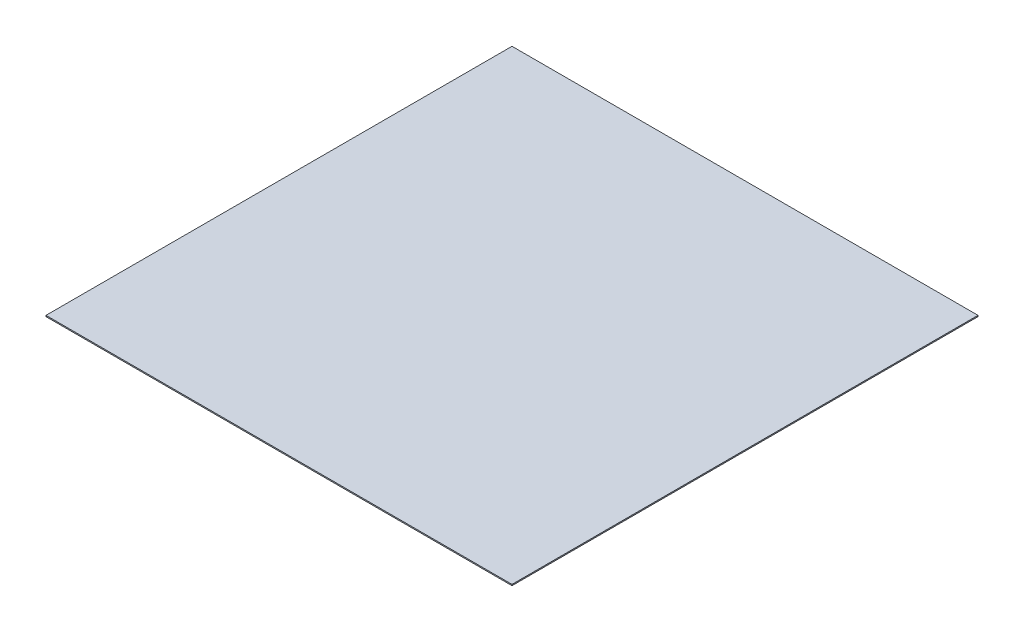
ISO-10303-21;
HEADER;
FILE_DESCRIPTION(('STEP AP214'),'2;1');
FILE_NAME('part.step','',(''),(''),'','','');
FILE_SCHEMA(('AUTOMOTIVE_DESIGN { 1 0 10303 214 1 1 1 1 }'));
ENDSEC;
DATA;
#1=APPLICATION_CONTEXT('core data for automotive mechanical design processes');
#2=APPLICATION_PROTOCOL_DEFINITION('international standard','automotive_design',2000,#1);
#3=PRODUCT_CONTEXT('',#1,'mechanical');
#4=PRODUCT('Part','Part','',(#3));
#5=PRODUCT_RELATED_PRODUCT_CATEGORY('part','',(#4));
#6=PRODUCT_DEFINITION_FORMATION('','',#4);
#7=PRODUCT_DEFINITION_CONTEXT('part definition',#1,'design');
#8=PRODUCT_DEFINITION('design','',#6,#7);
#9=PRODUCT_DEFINITION_SHAPE('','',#8);
#10=(LENGTH_UNIT() NAMED_UNIT(*) SI_UNIT(.MILLI.,.METRE.));
#11=(NAMED_UNIT(*) PLANE_ANGLE_UNIT() SI_UNIT($,.RADIAN.));
#12=(NAMED_UNIT(*) SI_UNIT($,.STERADIAN.) SOLID_ANGLE_UNIT());
#13=UNCERTAINTY_MEASURE_WITH_UNIT(LENGTH_MEASURE(1.E-05),#10,'distance_accuracy_value','');
#14=(GEOMETRIC_REPRESENTATION_CONTEXT(3) GLOBAL_UNCERTAINTY_ASSIGNED_CONTEXT((#13)) GLOBAL_UNIT_ASSIGNED_CONTEXT((#10,
#11,#12)) REPRESENTATION_CONTEXT('',''));
#15=CARTESIAN_POINT('',(0.,0.,0.));
#16=DIRECTION('',(0.,0.,1.));
#17=DIRECTION('',(1.,0.,0.));
#18=AXIS2_PLACEMENT_3D('',#15,#16,#17);
#19=CARTESIAN_POINT('',(-1000.,-5.,1000.));
#20=DIRECTION('',(0.,1.,0.));
#21=DIRECTION('',(0.,0.,1.));
#22=AXIS2_PLACEMENT_3D('',#19,#20,#21);
#23=PLANE('',#22);
#24=DIRECTION('',(1.,0.,0.));
#25=VECTOR('',#24,1.);
#26=CARTESIAN_POINT('',(-1000.,-5.,-1000.));
#27=LINE('',#26,#25);
#28=CARTESIAN_POINT('',(-1000.,-5.,-1000.));
#29=VERTEX_POINT('',#28);
#30=CARTESIAN_POINT('',(1000.,-5.,-1000.));
#31=VERTEX_POINT('',#30);
#32=EDGE_CURVE('E95',#29,#31,#27,.T.);
#33=ORIENTED_EDGE('',*,*,#32,.T.);
#34=DIRECTION('',(0.,0.,-1.));
#35=VECTOR('',#34,1.);
#36=CARTESIAN_POINT('',(1000.,-5.,1000.));
#37=LINE('',#36,#35);
#38=CARTESIAN_POINT('',(1000.,-5.,1000.));
#39=VERTEX_POINT('',#38);
#40=EDGE_CURVE('E11',#39,#31,#37,.T.);
#41=ORIENTED_EDGE('',*,*,#40,.F.);
#42=DIRECTION('',(1.,0.,0.));
#43=VECTOR('',#42,1.);
#44=CARTESIAN_POINT('',(-1000.,-5.,1000.));
#45=LINE('',#44,#43);
#46=CARTESIAN_POINT('',(-1000.,-5.,1000.));
#47=VERTEX_POINT('',#46);
#48=EDGE_CURVE('E72',#47,#39,#45,.T.);
#49=ORIENTED_EDGE('',*,*,#48,.F.);
#50=DIRECTION('',(0.,0.,-1.));
#51=VECTOR('',#50,1.);
#52=CARTESIAN_POINT('',(-1000.,-5.,1000.));
#53=LINE('',#52,#51);
#54=EDGE_CURVE('E48',#47,#29,#53,.T.);
#55=ORIENTED_EDGE('',*,*,#54,.T.);
#56=EDGE_LOOP('',(#33,#41,#49,#55));
#57=FACE_BOUND('',#56,.T.);
#58=ADVANCED_FACE('F32',(#57),#23,.F.);
#59=CARTESIAN_POINT('',(1000.,0.,1000.));
#60=DIRECTION('',(1.,0.,0.));
#61=DIRECTION('',(0.,0.,-1.));
#62=AXIS2_PLACEMENT_3D('',#59,#60,#61);
#63=PLANE('',#62);
#64=DIRECTION('',(0.,-1.,0.));
#65=VECTOR('',#64,1.);
#66=CARTESIAN_POINT('',(1000.,0.,-1000.));
#67=LINE('',#66,#65);
#68=CARTESIAN_POINT('',(1000.,0.,-1000.));
#69=VERTEX_POINT('',#68);
#70=EDGE_CURVE('E81',#69,#31,#67,.T.);
#71=ORIENTED_EDGE('',*,*,#70,.F.);
#72=DIRECTION('',(0.,0.,-1.));
#73=VECTOR('',#72,1.);
#74=CARTESIAN_POINT('',(1000.,0.,1000.));
#75=LINE('',#74,#73);
#76=CARTESIAN_POINT('',(1000.,0.,1000.));
#77=VERTEX_POINT('',#76);
#78=EDGE_CURVE('E40',#77,#69,#75,.T.);
#79=ORIENTED_EDGE('',*,*,#78,.F.);
#80=DIRECTION('',(0.,-1.,0.));
#81=VECTOR('',#80,1.);
#82=CARTESIAN_POINT('',(1000.,0.,1000.));
#83=LINE('',#82,#81);
#84=EDGE_CURVE('E79',#77,#39,#83,.T.);
#85=ORIENTED_EDGE('',*,*,#84,.T.);
#86=ORIENTED_EDGE('',*,*,#40,.T.);
#87=EDGE_LOOP('',(#71,#79,#85,#86));
#88=FACE_BOUND('',#87,.T.);
#89=ADVANCED_FACE('F78',(#88),#63,.T.);
#90=CARTESIAN_POINT('',(-1000.,0.,1000.));
#91=DIRECTION('',(0.,1.,0.));
#92=DIRECTION('',(0.,0.,1.));
#93=AXIS2_PLACEMENT_3D('',#90,#91,#92);
#94=PLANE('',#93);
#95=DIRECTION('',(1.,0.,0.));
#96=VECTOR('',#95,1.);
#97=CARTESIAN_POINT('',(-1000.,0.,-1000.));
#98=LINE('',#97,#96);
#99=CARTESIAN_POINT('',(-1000.,0.,-1000.));
#100=VERTEX_POINT('',#99);
#101=EDGE_CURVE('E98',#100,#69,#98,.T.);
#102=ORIENTED_EDGE('',*,*,#101,.F.);
#103=DIRECTION('',(0.,0.,-1.));
#104=VECTOR('',#103,1.);
#105=CARTESIAN_POINT('',(-1000.,0.,1000.));
#106=LINE('',#105,#104);
#107=CARTESIAN_POINT('',(-1000.,0.,1000.));
#108=VERTEX_POINT('',#107);
#109=EDGE_CURVE('E61',#108,#100,#106,.T.);
#110=ORIENTED_EDGE('',*,*,#109,.F.);
#111=DIRECTION('',(1.,0.,0.));
#112=VECTOR('',#111,1.);
#113=CARTESIAN_POINT('',(-1000.,0.,1000.));
#114=LINE('',#113,#112);
#115=EDGE_CURVE('E87',#108,#77,#114,.T.);
#116=ORIENTED_EDGE('',*,*,#115,.T.);
#117=ORIENTED_EDGE('',*,*,#78,.T.);
#118=EDGE_LOOP('',(#102,#110,#116,#117));
#119=FACE_BOUND('',#118,.T.);
#120=ADVANCED_FACE('F89',(#119),#94,.T.);
#121=CARTESIAN_POINT('',(-1000.,-5.,1000.));
#122=DIRECTION('',(-1.,0.,0.));
#123=DIRECTION('',(0.,0.,1.));
#124=AXIS2_PLACEMENT_3D('',#121,#122,#123);
#125=PLANE('',#124);
#126=DIRECTION('',(0.,1.,0.));
#127=VECTOR('',#126,1.);
#128=CARTESIAN_POINT('',(-1000.,-5.,-1000.));
#129=LINE('',#128,#127);
#130=EDGE_CURVE('E100',#29,#100,#129,.T.);
#131=ORIENTED_EDGE('',*,*,#130,.F.);
#132=ORIENTED_EDGE('',*,*,#54,.F.);
#133=DIRECTION('',(0.,1.,0.));
#134=VECTOR('',#133,1.);
#135=CARTESIAN_POINT('',(-1000.,-5.,1000.));
#136=LINE('',#135,#134);
#137=EDGE_CURVE('E90',#47,#108,#136,.T.);
#138=ORIENTED_EDGE('',*,*,#137,.T.);
#139=ORIENTED_EDGE('',*,*,#109,.T.);
#140=EDGE_LOOP('',(#131,#132,#138,#139));
#141=FACE_BOUND('',#140,.T.);
#142=ADVANCED_FACE('F106',(#141),#125,.T.);
#143=CARTESIAN_POINT('',(1000.,-5.,1000.));
#144=DIRECTION('',(0.,0.,-1.));
#145=DIRECTION('',(-1.,0.,0.));
#146=AXIS2_PLACEMENT_3D('',#143,#144,#145);
#147=PLANE('',#146);
#148=ORIENTED_EDGE('',*,*,#48,.T.);
#149=ORIENTED_EDGE('',*,*,#84,.F.);
#150=ORIENTED_EDGE('',*,*,#115,.F.);
#151=ORIENTED_EDGE('',*,*,#137,.F.);
#152=EDGE_LOOP('',(#148,#149,#150,#151));
#153=FACE_BOUND('',#152,.T.);
#154=ADVANCED_FACE('F86',(#153),#147,.F.);
#155=CARTESIAN_POINT('',(1000.,-5.,-1000.));
#156=DIRECTION('',(0.,0.,-1.));
#157=DIRECTION('',(-1.,0.,0.));
#158=AXIS2_PLACEMENT_3D('',#155,#156,#157);
#159=PLANE('',#158);
#160=ORIENTED_EDGE('',*,*,#32,.F.);
#161=ORIENTED_EDGE('',*,*,#130,.T.);
#162=ORIENTED_EDGE('',*,*,#101,.T.);
#163=ORIENTED_EDGE('',*,*,#70,.T.);
#164=EDGE_LOOP('',(#160,#161,#162,#163));
#165=FACE_BOUND('',#164,.T.);
#166=ADVANCED_FACE('F105',(#165),#159,.T.);
#167=CLOSED_SHELL('',(#58,#89,#120,#142,#154,#166));
#168=MANIFOLD_SOLID_BREP('B2',#167);
#169=ADVANCED_BREP_SHAPE_REPRESENTATION('',(#18,#168),#14);
#170=SHAPE_DEFINITION_REPRESENTATION(#9,#169);
ENDSEC;
END-ISO-10303-21;
